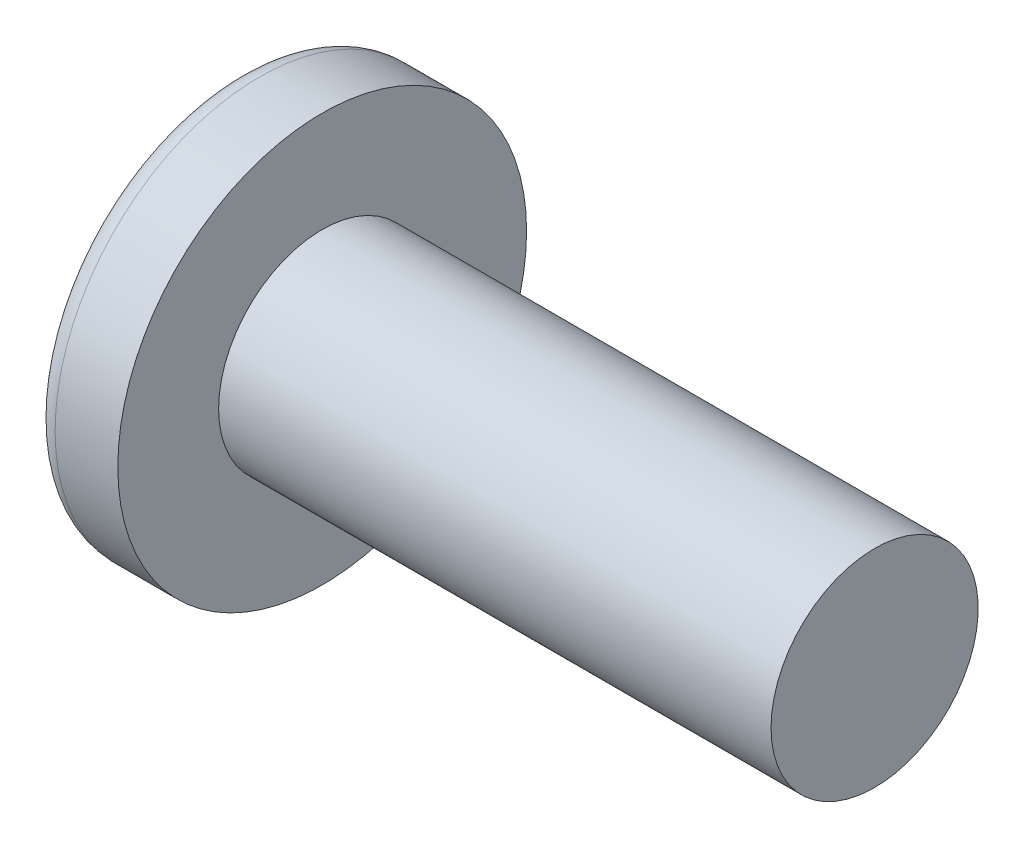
ISO-10303-21;
HEADER;
FILE_DESCRIPTION(('STEP AP214'),'2;1');
FILE_NAME('part.step','',(''),(''),'','','');
FILE_SCHEMA(('AUTOMOTIVE_DESIGN { 1 0 10303 214 1 1 1 1 }'));
ENDSEC;
DATA;
#1=APPLICATION_CONTEXT('core data for automotive mechanical design processes');
#2=APPLICATION_PROTOCOL_DEFINITION('international standard','automotive_design',2000,#1);
#3=PRODUCT_CONTEXT('',#1,'mechanical');
#4=PRODUCT('Part','Part','',(#3));
#5=PRODUCT_RELATED_PRODUCT_CATEGORY('part','',(#4));
#6=PRODUCT_DEFINITION_FORMATION('','',#4);
#7=PRODUCT_DEFINITION_CONTEXT('part definition',#1,'design');
#8=PRODUCT_DEFINITION('design','',#6,#7);
#9=PRODUCT_DEFINITION_SHAPE('','',#8);
#10=(LENGTH_UNIT() NAMED_UNIT(*) SI_UNIT(.MILLI.,.METRE.));
#11=(NAMED_UNIT(*) PLANE_ANGLE_UNIT() SI_UNIT($,.RADIAN.));
#12=(NAMED_UNIT(*) SI_UNIT($,.STERADIAN.) SOLID_ANGLE_UNIT());
#13=UNCERTAINTY_MEASURE_WITH_UNIT(LENGTH_MEASURE(1.E-05),#10,'distance_accuracy_value','');
#14=(GEOMETRIC_REPRESENTATION_CONTEXT(3) GLOBAL_UNCERTAINTY_ASSIGNED_CONTEXT((#13)) GLOBAL_UNIT_ASSIGNED_CONTEXT((#10,
#11,#12)) REPRESENTATION_CONTEXT('',''));
#15=CARTESIAN_POINT('',(0.,0.,0.));
#16=DIRECTION('',(0.,0.,1.));
#17=DIRECTION('',(1.,0.,0.));
#18=AXIS2_PLACEMENT_3D('',#15,#16,#17);
#19=CARTESIAN_POINT('',(15.24,0.,0.));
#20=DIRECTION('',(-1.,0.,0.));
#21=DIRECTION('',(0.,1.,0.));
#22=AXIS2_PLACEMENT_3D('',#19,#20,#21);
#23=SPHERICAL_SURFACE('',#22,15.24);
#24=CARTESIAN_POINT('',(2.92722732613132,0.,0.));
#25=DIRECTION('',(-1.,0.,0.));
#26=DIRECTION('',(0.,0.,1.));
#27=AXIS2_PLACEMENT_3D('',#24,#25,#26);
#28=CIRCLE('',#27,8.98071428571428);
#29=CARTESIAN_POINT('',(2.92722732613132,0.,8.98071428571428));
#30=VERTEX_POINT('',#29);
#31=EDGE_CURVE('E152',#30,#30,#28,.T.);
#32=ORIENTED_EDGE('',*,*,#31,.T.);
#33=EDGE_LOOP('',(#32));
#34=FACE_BOUND('',#33,.T.);
#35=CARTESIAN_POINT('',(15.2364523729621,-0.0501047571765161,0.));
#36=DIRECTION('',(-0.0706273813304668,-0.997502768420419,0.));
#37=DIRECTION('',(0.997502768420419,-0.0706273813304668,0.));
#38=AXIS2_PLACEMENT_3D('',#35,#36,#37);
#39=CIRCLE('',#38,15.239917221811);
#40=CARTESIAN_POINT('',(0.995146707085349,0.95823943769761,5.33137241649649));
#41=VERTEX_POINT('',#40);
#42=CARTESIAN_POINT('',(0.0689357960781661,1.02381905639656,1.02381905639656));
#43=VERTEX_POINT('',#42);
#44=EDGE_CURVE('E183',#41,#43,#39,.T.);
#45=ORIENTED_EDGE('',*,*,#44,.F.);
#46=CARTESIAN_POINT('',(12.5278255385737,0.,-3.52983797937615));
#47=DIRECTION('',(0.609275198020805,0.,0.79295884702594));
#48=DIRECTION('',(0.79295884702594,0.,-0.609275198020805));
#49=AXIS2_PLACEMENT_3D('',#46,#47,#48);
#50=CIRCLE('',#49,14.5753886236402);
#51=CARTESIAN_POINT('',(0.995146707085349,-0.958239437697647,5.33137241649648));
#52=VERTEX_POINT('',#51);
#53=EDGE_CURVE('E148',#41,#52,#50,.T.);
#54=ORIENTED_EDGE('',*,*,#53,.T.);
#55=CARTESIAN_POINT('',(15.2364523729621,0.0501047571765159,0.));
#56=DIRECTION('',(-0.0706273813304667,0.997502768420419,0.));
#57=DIRECTION('',(-0.997502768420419,-0.0706273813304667,0.));
#58=AXIS2_PLACEMENT_3D('',#55,#56,#57);
#59=CIRCLE('',#58,15.239917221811);
#60=CARTESIAN_POINT('',(0.0689357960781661,-1.02381905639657,1.02381905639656));
#61=VERTEX_POINT('',#60);
#62=EDGE_CURVE('E104',#61,#52,#59,.T.);
#63=ORIENTED_EDGE('',*,*,#62,.F.);
#64=CARTESIAN_POINT('',(15.2364523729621,0.,-0.050104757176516));
#65=DIRECTION('',(-0.0706273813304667,0.,-0.997502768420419));
#66=DIRECTION('',(-0.997502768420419,0.,0.0706273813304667));
#67=AXIS2_PLACEMENT_3D('',#64,#65,#66);
#68=CIRCLE('',#67,15.239917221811);
#69=CARTESIAN_POINT('',(0.995146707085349,-5.33137241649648,0.958239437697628));
#70=VERTEX_POINT('',#69);
#71=EDGE_CURVE('E129',#70,#61,#68,.T.);
#72=ORIENTED_EDGE('',*,*,#71,.F.);
#73=CARTESIAN_POINT('',(12.5278255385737,3.52983797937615,0.));
#74=DIRECTION('',(0.609275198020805,-0.79295884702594,0.));
#75=DIRECTION('',(0.79295884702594,0.609275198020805,0.));
#76=AXIS2_PLACEMENT_3D('',#73,#74,#75);
#77=CIRCLE('',#76,14.5753886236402);
#78=CARTESIAN_POINT('',(0.995146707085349,-5.33137241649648,-0.958239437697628));
#79=VERTEX_POINT('',#78);
#80=EDGE_CURVE('E137',#70,#79,#77,.T.);
#81=ORIENTED_EDGE('',*,*,#80,.T.);
#82=CARTESIAN_POINT('',(15.2364523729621,0.,0.0501047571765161));
#83=DIRECTION('',(-0.0706273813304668,0.,0.997502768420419));
#84=DIRECTION('',(0.997502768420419,0.,0.0706273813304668));
#85=AXIS2_PLACEMENT_3D('',#82,#83,#84);
#86=CIRCLE('',#85,15.239917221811);
#87=CARTESIAN_POINT('',(0.0689357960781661,-1.02381905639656,-1.02381905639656));
#88=VERTEX_POINT('',#87);
#89=EDGE_CURVE('E47',#88,#79,#86,.T.);
#90=ORIENTED_EDGE('',*,*,#89,.F.);
#91=CARTESIAN_POINT('',(0.995146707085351,-0.958239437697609,-5.33137241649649));
#92=VERTEX_POINT('',#91);
#93=EDGE_CURVE('E190',#92,#88,#59,.T.);
#94=ORIENTED_EDGE('',*,*,#93,.F.);
#95=CARTESIAN_POINT('',(12.5278255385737,0.,3.52983797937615));
#96=DIRECTION('',(0.609275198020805,0.,-0.79295884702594));
#97=DIRECTION('',(-0.79295884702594,0.,-0.609275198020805));
#98=AXIS2_PLACEMENT_3D('',#95,#96,#97);
#99=CIRCLE('',#98,14.5753886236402);
#100=CARTESIAN_POINT('',(0.995146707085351,0.958239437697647,-5.33137241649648));
#101=VERTEX_POINT('',#100);
#102=EDGE_CURVE('E130',#92,#101,#99,.T.);
#103=ORIENTED_EDGE('',*,*,#102,.T.);
#104=CARTESIAN_POINT('',(0.0689357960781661,1.02381905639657,-1.02381905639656));
#105=VERTEX_POINT('',#104);
#106=EDGE_CURVE('E178',#105,#101,#39,.T.);
#107=ORIENTED_EDGE('',*,*,#106,.F.);
#108=CARTESIAN_POINT('',(0.995146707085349,5.33137241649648,-0.958239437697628));
#109=VERTEX_POINT('',#108);
#110=EDGE_CURVE('E40',#109,#105,#86,.T.);
#111=ORIENTED_EDGE('',*,*,#110,.F.);
#112=CARTESIAN_POINT('',(12.5278255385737,-3.52983797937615,0.));
#113=DIRECTION('',(0.609275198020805,0.79295884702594,0.));
#114=DIRECTION('',(-0.79295884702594,0.609275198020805,0.));
#115=AXIS2_PLACEMENT_3D('',#112,#113,#114);
#116=CIRCLE('',#115,14.5753886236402);
#117=CARTESIAN_POINT('',(0.995146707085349,5.33137241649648,0.958239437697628));
#118=VERTEX_POINT('',#117);
#119=EDGE_CURVE('E11',#109,#118,#116,.T.);
#120=ORIENTED_EDGE('',*,*,#119,.T.);
#121=EDGE_CURVE('E166',#43,#118,#68,.T.);
#122=ORIENTED_EDGE('',*,*,#121,.F.);
#123=EDGE_LOOP('',(#45,#54,#63,#72,#81,#90,#94,#103,#107,#111,#120,#122));
#124=FACE_BOUND('',#123,.T.);
#125=ADVANCED_FACE('F32',(#34,#124),#23,.T.);
#126=CARTESIAN_POINT('',(7.9338156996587,0.,-0.466952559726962));
#127=DIRECTION('',(-0.0706273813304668,0.,0.997502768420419));
#128=DIRECTION('',(0.997502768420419,0.,0.0706273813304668));
#129=AXIS2_PLACEMENT_3D('',#126,#127,#128);
#130=PLANE('',#129);
#131=ORIENTED_EDGE('',*,*,#110,.T.);
#132=DIRECTION('',(0.995024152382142,-0.0704518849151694,0.0704518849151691));
#133=VECTOR('',#132,1.);
#134=CARTESIAN_POINT('',(7.96654969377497,0.464634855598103,-0.464634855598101));
#135=LINE('',#134,#133);
#136=CARTESIAN_POINT('',(7.2644,0.514350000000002,-0.514349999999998));
#137=VERTEX_POINT('',#136);
#138=EDGE_CURVE('E172',#105,#137,#135,.T.);
#139=ORIENTED_EDGE('',*,*,#138,.T.);
#140=DIRECTION('',(0.791711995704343,-0.608317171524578,0.0560565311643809));
#141=VECTOR('',#140,1.);
#142=CARTESIAN_POINT('',(0.,6.096,-1.0287));
#143=LINE('',#142,#141);
#144=EDGE_CURVE('E153',#109,#137,#143,.T.);
#145=ORIENTED_EDGE('',*,*,#144,.F.);
#146=EDGE_LOOP('',(#131,#139,#145));
#147=FACE_BOUND('',#146,.T.);
#148=ADVANCED_FACE('F171',(#147),#130,.T.);
#149=DIRECTION('',(0.791711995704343,0.608317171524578,0.0560565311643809));
#150=VECTOR('',#149,1.);
#151=CARTESIAN_POINT('',(0.,-6.096,-1.0287));
#152=LINE('',#151,#150);
#153=CARTESIAN_POINT('',(7.2644,-0.51435,-0.51435));
#154=VERTEX_POINT('',#153);
#155=EDGE_CURVE('E138',#79,#154,#152,.T.);
#156=ORIENTED_EDGE('',*,*,#155,.T.);
#157=DIRECTION('',(-0.995024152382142,-0.0704518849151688,-0.0704518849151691));
#158=VECTOR('',#157,1.);
#159=CARTESIAN_POINT('',(7.96654969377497,-0.464634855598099,-0.464634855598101));
#160=LINE('',#159,#158);
#161=EDGE_CURVE('E193',#154,#88,#160,.T.);
#162=ORIENTED_EDGE('',*,*,#161,.T.);
#163=ORIENTED_EDGE('',*,*,#89,.T.);
#164=EDGE_LOOP('',(#156,#162,#163));
#165=FACE_BOUND('',#164,.T.);
#166=ADVANCED_FACE('F208',(#165),#130,.T.);
#167=CARTESIAN_POINT('',(7.9338156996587,0.,0.466952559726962));
#168=DIRECTION('',(-0.0706273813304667,0.,-0.997502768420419));
#169=DIRECTION('',(-0.997502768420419,0.,0.0706273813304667));
#170=AXIS2_PLACEMENT_3D('',#167,#168,#169);
#171=PLANE('',#170);
#172=DIRECTION('',(0.791711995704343,-0.608317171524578,-0.056056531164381));
#173=VECTOR('',#172,1.);
#174=CARTESIAN_POINT('',(0.,6.096,1.0287));
#175=LINE('',#174,#173);
#176=CARTESIAN_POINT('',(7.2644,0.51435,0.51435));
#177=VERTEX_POINT('',#176);
#178=EDGE_CURVE('E209',#118,#177,#175,.T.);
#179=ORIENTED_EDGE('',*,*,#178,.T.);
#180=DIRECTION('',(-0.995024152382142,0.0704518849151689,0.0704518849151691));
#181=VECTOR('',#180,1.);
#182=CARTESIAN_POINT('',(7.96654969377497,0.464634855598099,0.464634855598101));
#183=LINE('',#182,#181);
#184=EDGE_CURVE('E187',#177,#43,#183,.T.);
#185=ORIENTED_EDGE('',*,*,#184,.T.);
#186=ORIENTED_EDGE('',*,*,#121,.T.);
#187=EDGE_LOOP('',(#179,#185,#186));
#188=FACE_BOUND('',#187,.T.);
#189=ADVANCED_FACE('F213',(#188),#171,.T.);
#190=ORIENTED_EDGE('',*,*,#71,.T.);
#191=DIRECTION('',(0.995024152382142,0.0704518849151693,-0.0704518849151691));
#192=VECTOR('',#191,1.);
#193=CARTESIAN_POINT('',(7.96654969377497,-0.464634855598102,0.464634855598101));
#194=LINE('',#193,#192);
#195=CARTESIAN_POINT('',(7.2644,-0.514350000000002,0.514349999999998));
#196=VERTEX_POINT('',#195);
#197=EDGE_CURVE('E102',#61,#196,#194,.T.);
#198=ORIENTED_EDGE('',*,*,#197,.T.);
#199=DIRECTION('',(0.791711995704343,0.608317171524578,-0.0560565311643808));
#200=VECTOR('',#199,1.);
#201=CARTESIAN_POINT('',(0.,-6.096,1.0287));
#202=LINE('',#201,#200);
#203=EDGE_CURVE('E127',#70,#196,#202,.T.);
#204=ORIENTED_EDGE('',*,*,#203,.F.);
#205=EDGE_LOOP('',(#190,#198,#204));
#206=FACE_BOUND('',#205,.T.);
#207=ADVANCED_FACE('F126',(#206),#171,.T.);
#208=CARTESIAN_POINT('',(-25.4,0.,0.));
#209=DIRECTION('',(-1.,0.,0.));
#210=DIRECTION('',(0.,0.,1.));
#211=AXIS2_PLACEMENT_3D('',#208,#209,#210);
#212=CYLINDRICAL_SURFACE('',#211,4.7625);
#213=CARTESIAN_POINT('',(32.0294,0.,0.));
#214=DIRECTION('',(-1.,0.,0.));
#215=DIRECTION('',(0.,0.,1.));
#216=AXIS2_PLACEMENT_3D('',#213,#214,#215);
#217=CIRCLE('',#216,4.7625);
#218=CARTESIAN_POINT('',(32.0294,0.,4.7625));
#219=VERTEX_POINT('',#218);
#220=EDGE_CURVE('E149',#219,#219,#217,.T.);
#221=ORIENTED_EDGE('',*,*,#220,.T.);
#222=EDGE_LOOP('',(#221));
#223=FACE_BOUND('',#222,.T.);
#224=CARTESIAN_POINT('',(6.6294,0.,0.));
#225=DIRECTION('',(-1.,0.,0.));
#226=DIRECTION('',(0.,0.,1.));
#227=AXIS2_PLACEMENT_3D('',#224,#225,#226);
#228=CIRCLE('',#227,4.7625);
#229=CARTESIAN_POINT('',(6.6294,0.,4.7625));
#230=VERTEX_POINT('',#229);
#231=EDGE_CURVE('E162',#230,#230,#228,.T.);
#232=ORIENTED_EDGE('',*,*,#231,.F.);
#233=EDGE_LOOP('',(#232));
#234=FACE_BOUND('',#233,.T.);
#235=ADVANCED_FACE('F34',(#223,#234),#212,.T.);
#236=CARTESIAN_POINT('',(6.6294,4.7625,0.));
#237=DIRECTION('',(-1.,0.,0.));
#238=DIRECTION('',(0.,0.,1.));
#239=AXIS2_PLACEMENT_3D('',#236,#237,#238);
#240=PLANE('',#239);
#241=CARTESIAN_POINT('',(6.6294,0.,0.));
#242=DIRECTION('',(-1.,0.,0.));
#243=DIRECTION('',(0.,0.,1.));
#244=AXIS2_PLACEMENT_3D('',#241,#242,#243);
#245=CIRCLE('',#244,9.398);
#246=CARTESIAN_POINT('',(6.6294,0.,9.398));
#247=VERTEX_POINT('',#246);
#248=EDGE_CURVE('E159',#247,#247,#245,.T.);
#249=ORIENTED_EDGE('',*,*,#248,.F.);
#250=EDGE_LOOP('',(#249));
#251=FACE_BOUND('',#250,.T.);
#252=ORIENTED_EDGE('',*,*,#231,.T.);
#253=EDGE_LOOP('',(#252));
#254=FACE_BOUND('',#253,.T.);
#255=ADVANCED_FACE('F241',(#251,#254),#240,.F.);
#256=CARTESIAN_POINT('',(-25.4,0.,0.));
#257=DIRECTION('',(-1.,0.,0.));
#258=DIRECTION('',(0.,0.,1.));
#259=AXIS2_PLACEMENT_3D('',#256,#257,#258);
#260=CYLINDRICAL_SURFACE('',#259,9.398);
#261=ORIENTED_EDGE('',*,*,#248,.T.);
#262=EDGE_LOOP('',(#261));
#263=FACE_BOUND('',#262,.T.);
#264=CARTESIAN_POINT('',(3.74807883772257,0.,0.));
#265=DIRECTION('',(-1.,0.,0.));
#266=DIRECTION('',(0.,0.,1.));
#267=AXIS2_PLACEMENT_3D('',#264,#265,#266);
#268=CIRCLE('',#267,9.398);
#269=CARTESIAN_POINT('',(3.74807883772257,0.,9.398));
#270=VERTEX_POINT('',#269);
#271=EDGE_CURVE('E156',#270,#270,#268,.T.);
#272=ORIENTED_EDGE('',*,*,#271,.F.);
#273=EDGE_LOOP('',(#272));
#274=FACE_BOUND('',#273,.T.);
#275=ADVANCED_FACE('F238',(#263,#274),#260,.T.);
#276=CARTESIAN_POINT('',(3.74807883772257,0.,0.));
#277=DIRECTION('',(-1.,0.,0.));
#278=DIRECTION('',(0.,0.,1.));
#279=AXIS2_PLACEMENT_3D('',#276,#277,#278);
#280=TOROIDAL_SURFACE('',#279,8.382,1.016);
#281=ORIENTED_EDGE('',*,*,#271,.T.);
#282=EDGE_LOOP('',(#281));
#283=FACE_BOUND('',#282,.T.);
#284=ORIENTED_EDGE('',*,*,#31,.F.);
#285=EDGE_LOOP('',(#284));
#286=FACE_BOUND('',#285,.T.);
#287=ADVANCED_FACE('F235',(#283,#286),#280,.T.);
#288=CARTESIAN_POINT('',(32.0294,4.7625,0.));
#289=DIRECTION('',(1.,0.,0.));
#290=DIRECTION('',(0.,0.,-1.));
#291=AXIS2_PLACEMENT_3D('',#288,#289,#290);
#292=PLANE('',#291);
#293=ORIENTED_EDGE('',*,*,#220,.F.);
#294=EDGE_LOOP('',(#293));
#295=FACE_BOUND('',#294,.T.);
#296=ADVANCED_FACE('F233',(#295),#292,.T.);
#297=CARTESIAN_POINT('',(7.2644,0.51435,0.51435));
#298=DIRECTION('',(0.609275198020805,0.79295884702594,0.));
#299=DIRECTION('',(-0.79295884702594,0.609275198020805,0.));
#300=AXIS2_PLACEMENT_3D('',#297,#298,#299);
#301=PLANE('',#300);
#302=ORIENTED_EDGE('',*,*,#144,.T.);
#303=DIRECTION('',(0.,0.,-1.));
#304=VECTOR('',#303,1.);
#305=CARTESIAN_POINT('',(7.2644,0.51435,0.51435));
#306=LINE('',#305,#304);
#307=EDGE_CURVE('E120',#177,#137,#306,.T.);
#308=ORIENTED_EDGE('',*,*,#307,.F.);
#309=ORIENTED_EDGE('',*,*,#178,.F.);
#310=ORIENTED_EDGE('',*,*,#119,.F.);
#311=EDGE_LOOP('',(#302,#308,#309,#310));
#312=FACE_BOUND('',#311,.T.);
#313=ADVANCED_FACE('F212',(#312),#301,.F.);
#314=CARTESIAN_POINT('',(7.2644,-0.51435,-0.51435));
#315=DIRECTION('',(0.609275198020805,-0.79295884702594,0.));
#316=DIRECTION('',(0.79295884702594,0.609275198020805,0.));
#317=AXIS2_PLACEMENT_3D('',#314,#315,#316);
#318=PLANE('',#317);
#319=ORIENTED_EDGE('',*,*,#203,.T.);
#320=DIRECTION('',(0.,0.,1.));
#321=VECTOR('',#320,1.);
#322=CARTESIAN_POINT('',(7.2644,-0.51435,-0.51435));
#323=LINE('',#322,#321);
#324=EDGE_CURVE('E119',#154,#196,#323,.T.);
#325=ORIENTED_EDGE('',*,*,#324,.F.);
#326=ORIENTED_EDGE('',*,*,#155,.F.);
#327=ORIENTED_EDGE('',*,*,#80,.F.);
#328=EDGE_LOOP('',(#319,#325,#326,#327));
#329=FACE_BOUND('',#328,.T.);
#330=ADVANCED_FACE('F134',(#329),#318,.F.);
#331=CARTESIAN_POINT('',(7.2644,0.51435,-0.51435));
#332=DIRECTION('',(-1.,0.,0.));
#333=DIRECTION('',(0.,0.,1.));
#334=AXIS2_PLACEMENT_3D('',#331,#332,#333);
#335=PLANE('',#334);
#336=DIRECTION('',(0.,1.,0.));
#337=VECTOR('',#336,1.);
#338=CARTESIAN_POINT('',(7.2644,-0.51435,-0.51435));
#339=LINE('',#338,#337);
#340=EDGE_CURVE('E142',#154,#137,#339,.T.);
#341=ORIENTED_EDGE('',*,*,#340,.F.);
#342=ORIENTED_EDGE('',*,*,#324,.T.);
#343=DIRECTION('',(0.,-1.,0.));
#344=VECTOR('',#343,1.);
#345=CARTESIAN_POINT('',(7.2644,0.51435,0.51435));
#346=LINE('',#345,#344);
#347=EDGE_CURVE('E111',#177,#196,#346,.T.);
#348=ORIENTED_EDGE('',*,*,#347,.F.);
#349=ORIENTED_EDGE('',*,*,#307,.T.);
#350=EDGE_LOOP('',(#341,#342,#348,#349));
#351=FACE_BOUND('',#350,.T.);
#352=ADVANCED_FACE('F140',(#351),#335,.T.);
#353=CARTESIAN_POINT('',(7.2644,0.514350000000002,-0.514349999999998));
#354=DIRECTION('',(0.609275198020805,0.,-0.79295884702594));
#355=DIRECTION('',(0.79295884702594,0.,0.609275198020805));
#356=AXIS2_PLACEMENT_3D('',#353,#354,#355);
#357=PLANE('',#356);
#358=DIRECTION('',(0.791711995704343,0.0560565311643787,0.608317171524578));
#359=VECTOR('',#358,1.);
#360=CARTESIAN_POINT('',(0.,-1.02869999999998,-6.096));
#361=LINE('',#360,#359);
#362=EDGE_CURVE('E198',#92,#154,#361,.T.);
#363=ORIENTED_EDGE('',*,*,#362,.T.);
#364=ORIENTED_EDGE('',*,*,#340,.T.);
#365=DIRECTION('',(0.791711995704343,-0.0560565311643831,0.608317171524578));
#366=VECTOR('',#365,1.);
#367=CARTESIAN_POINT('',(0.,1.02870000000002,-6.096));
#368=LINE('',#367,#366);
#369=EDGE_CURVE('E108',#101,#137,#368,.T.);
#370=ORIENTED_EDGE('',*,*,#369,.F.);
#371=ORIENTED_EDGE('',*,*,#102,.F.);
#372=EDGE_LOOP('',(#363,#364,#370,#371));
#373=FACE_BOUND('',#372,.T.);
#374=ADVANCED_FACE('F203',(#373),#357,.F.);
#375=CARTESIAN_POINT('',(7.9338156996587,-0.466952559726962,0.));
#376=DIRECTION('',(-0.0706273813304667,0.997502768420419,0.));
#377=DIRECTION('',(-0.997502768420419,-0.0706273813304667,0.));
#378=AXIS2_PLACEMENT_3D('',#375,#376,#377);
#379=PLANE('',#378);
#380=ORIENTED_EDGE('',*,*,#93,.T.);
#381=ORIENTED_EDGE('',*,*,#161,.F.);
#382=ORIENTED_EDGE('',*,*,#362,.F.);
#383=EDGE_LOOP('',(#380,#381,#382));
#384=FACE_BOUND('',#383,.T.);
#385=ADVANCED_FACE('F207',(#384),#379,.T.);
#386=CARTESIAN_POINT('',(7.9338156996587,0.466952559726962,0.));
#387=DIRECTION('',(-0.0706273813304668,-0.997502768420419,0.));
#388=DIRECTION('',(0.997502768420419,-0.0706273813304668,0.));
#389=AXIS2_PLACEMENT_3D('',#386,#387,#388);
#390=PLANE('',#389);
#391=ORIENTED_EDGE('',*,*,#106,.T.);
#392=ORIENTED_EDGE('',*,*,#369,.T.);
#393=ORIENTED_EDGE('',*,*,#138,.F.);
#394=EDGE_LOOP('',(#391,#392,#393));
#395=FACE_BOUND('',#394,.T.);
#396=ADVANCED_FACE('F201',(#395),#390,.T.);
#397=CARTESIAN_POINT('',(7.2644,-0.514350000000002,0.514349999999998));
#398=DIRECTION('',(0.609275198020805,0.,0.79295884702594));
#399=DIRECTION('',(-0.79295884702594,0.,0.609275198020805));
#400=AXIS2_PLACEMENT_3D('',#397,#398,#399);
#401=PLANE('',#400);
#402=DIRECTION('',(0.791711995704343,-0.0560565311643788,-0.608317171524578));
#403=VECTOR('',#402,1.);
#404=CARTESIAN_POINT('',(0.,1.02869999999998,6.096));
#405=LINE('',#404,#403);
#406=EDGE_CURVE('E107',#41,#177,#405,.T.);
#407=ORIENTED_EDGE('',*,*,#406,.T.);
#408=ORIENTED_EDGE('',*,*,#347,.T.);
#409=DIRECTION('',(0.791711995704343,0.0560565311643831,-0.608317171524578));
#410=VECTOR('',#409,1.);
#411=CARTESIAN_POINT('',(0.,-1.02870000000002,6.096));
#412=LINE('',#411,#410);
#413=EDGE_CURVE('E98',#52,#196,#412,.T.);
#414=ORIENTED_EDGE('',*,*,#413,.F.);
#415=ORIENTED_EDGE('',*,*,#53,.F.);
#416=EDGE_LOOP('',(#407,#408,#414,#415));
#417=FACE_BOUND('',#416,.T.);
#418=ADVANCED_FACE('F112',(#417),#401,.F.);
#419=ORIENTED_EDGE('',*,*,#44,.T.);
#420=ORIENTED_EDGE('',*,*,#184,.F.);
#421=ORIENTED_EDGE('',*,*,#406,.F.);
#422=EDGE_LOOP('',(#419,#420,#421));
#423=FACE_BOUND('',#422,.T.);
#424=ADVANCED_FACE('F214',(#423),#390,.T.);
#425=ORIENTED_EDGE('',*,*,#62,.T.);
#426=ORIENTED_EDGE('',*,*,#413,.T.);
#427=ORIENTED_EDGE('',*,*,#197,.F.);
#428=EDGE_LOOP('',(#425,#426,#427));
#429=FACE_BOUND('',#428,.T.);
#430=ADVANCED_FACE('F100',(#429),#379,.T.);
#431=CLOSED_SHELL('',(#125,#148,#166,#189,#207,#235,#255,#275,#287,#296,#313,#330,#352,#374,
#385,#396,#418,#424,#430));
#432=MANIFOLD_SOLID_BREP('B2',#431);
#433=ADVANCED_BREP_SHAPE_REPRESENTATION('',(#18,#432),#14);
#434=SHAPE_DEFINITION_REPRESENTATION(#9,#433);
ENDSEC;
END-ISO-10303-21;
